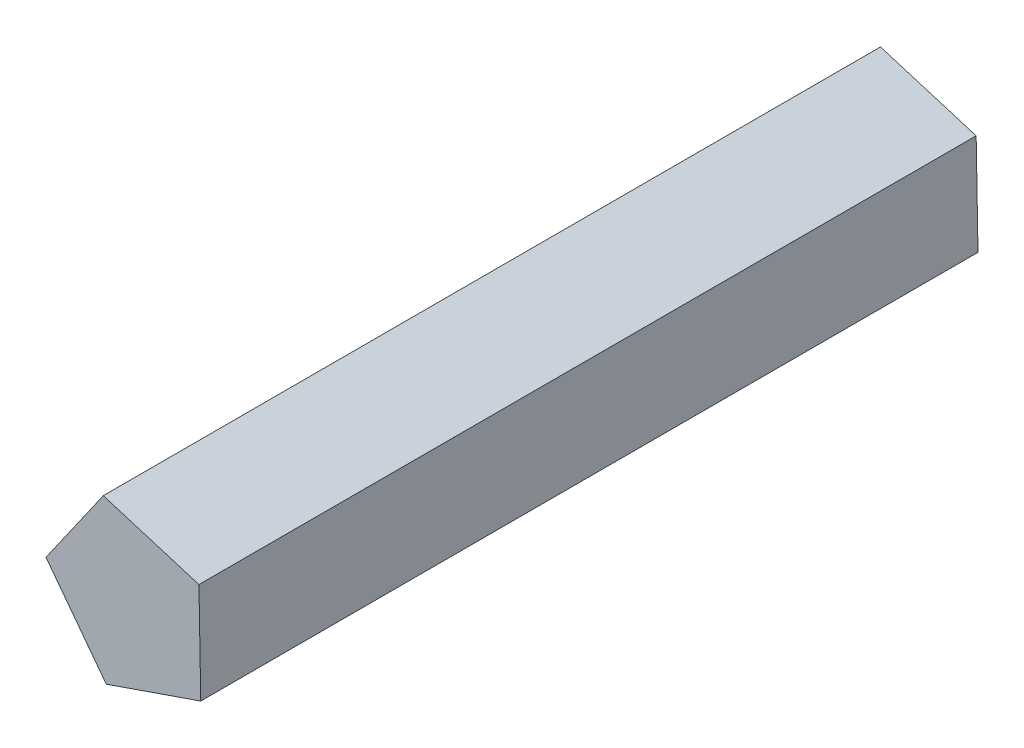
from build123d import *

# Parameters (mm, degrees)
BOSS_EXTRUDE1_DEPTH = 24


with BuildPart() as part:
    # Sketch1 → Boss-Extrude1 (new body)
    with BuildSketch(Plane.XY):
        Polygon((14.053946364, 2.254292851), (13.997085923, 5.341575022), (11.043335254, 6.241520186), (9.274677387, 3.710434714), (11.13533738, 1.2461927), align=None)
    extrude(amount=BOSS_EXTRUDE1_DEPTH)


solid = part.part
